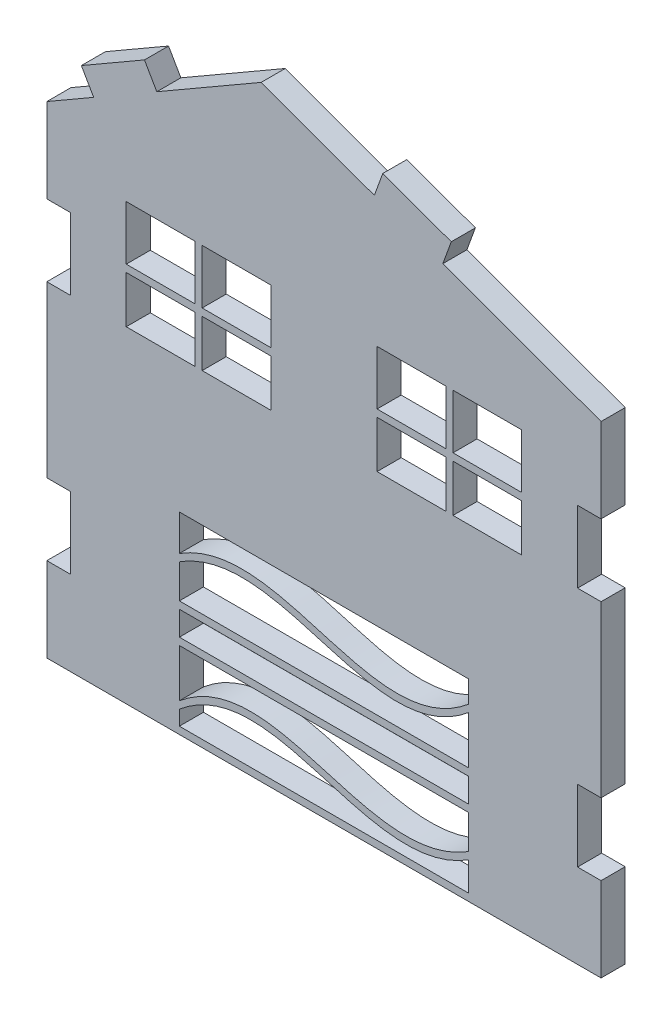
from build123d import *

# Parameters (mm, degrees)
SKETCH1_W           = 120
SKETCH1_H           = 10.03622205
SKETCH1_W_2         = 28.5
SKETCH1_H_2         = 22.5
SKETCH1_H_3         = 19.5
BOSS_EXTRUDE1_DEPTH = 10


with BuildPart() as part:
    # Sketch1 → Boss-Extrude1 (new body)
    with BuildSketch(Plane.XY):
        Polygon((-230, 0), (0, 0), (0, 35), (-9.76, 35), (-9.76, 64.76), (0, 64.76), (0, 135.24), (-9.76, 135.24), (-9.76, 165), (0, 165), (0, 175), (0, 200), (-65.667447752, 223.900996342), (-62.165161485, 233.523448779), (-90.581466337, 243.866137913), (-94.083752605, 234.243685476), (-141.068383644, 251.344692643), (-184.369653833, 226.344692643), (-189.489653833, 235.212792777), (-215.678262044, 220.092792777), (-210.558262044, 211.224692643), (-230, 200), (-230, 175), (-230, 165), (-220.24, 165), (-220.24, 135.24), (-230, 135.24), (-230, 64.76), (-220.24, 64.76), (-220.24, 35), (-230, 35), align=None)
        with Locations((-115, 40.018111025)):
            Rectangle(SKETCH1_W, SKETCH1_H, mode=Mode.SUBTRACT)
        with BuildLine():
            Line((-175, 80), (-55, 80))
            Line((-55, 80), (-55, 70.902148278))
            add(Edge.make_bspline(
                [(-175, 65.078208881), (-134.061450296, 90.844662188), (-93.755078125, 38.528093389), (-55, 70.902148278)],
                knots=[0, 0, 0, 0, 1, 1, 1, 1], degree=3))
            Line((-175, 65.078208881), (-175, 80))
        make_face(mode=Mode.SUBTRACT)
        with BuildLine():
            Line((-175, 32), (-55, 32))
            Line((-55, 32), (-55, 17.958013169))
            add(Edge.make_bspline(
                [(-55, 17.958013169), (-95.938549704, -7.808440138), (-136.244921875, 44.508128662), (-175, 12.134073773)],
                knots=[0, 0, 0, 0, 1, 1, 1, 1], degree=3))
            Line((-175, 12.134073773), (-175, 32))
        make_face(mode=Mode.SUBTRACT)
        with BuildLine():
            Line((-175, 62.078208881), (-175, 48.03622205))
            Line((-175, 48.03622205), (-55, 48.03622205))
            Line((-55, 48.03622205), (-55, 67.902148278))
            add(Edge.make_bspline(
                [(-175, 62.078208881), (-134.061450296, 87.844662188), (-93.755078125, 35.528093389), (-55, 67.902148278)],
                knots=[0, 0, 0, 0, 1, 1, 1, 1], degree=3))
        make_face(mode=Mode.SUBTRACT)
        with BuildLine():
            Line((-55, 14.958013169), (-55, 3))
            Line((-55, 3), (-175, 3))
            Line((-175, 3), (-175, 9.134073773))
            add(Edge.make_bspline(
                [(-55, 14.958013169), (-95.938549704, -10.808440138), (-136.244921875, 41.508128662), (-175, 9.134073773)],
                knots=[0, 0, 0, 0, 1, 1, 1, 1], degree=3))
        make_face(mode=Mode.SUBTRACT)
        with Locations((-182.801577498, 169.277582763)):
            Rectangle(SKETCH1_W_2, SKETCH1_H_2, mode=Mode.SUBTRACT)
        with Locations((-182.801577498, 145.277582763)):
            Rectangle(SKETCH1_W_2, SKETCH1_H_3, mode=Mode.SUBTRACT)
        with Locations((-151.301577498, 169.277582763)):
            Rectangle(SKETCH1_W_2, SKETCH1_H_2, mode=Mode.SUBTRACT)
        with Locations((-151.301577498, 145.277582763)):
            Rectangle(SKETCH1_W_2, SKETCH1_H_3, mode=Mode.SUBTRACT)
        with Locations((-78.698422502, 145.277582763)):
            Rectangle(SKETCH1_W_2, SKETCH1_H_3, mode=Mode.SUBTRACT)
        with Locations((-78.698422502, 169.277582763)):
            Rectangle(SKETCH1_W_2, SKETCH1_H_2, mode=Mode.SUBTRACT)
        with Locations((-47.198422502, 145.277582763)):
            Rectangle(SKETCH1_W_2, SKETCH1_H_3, mode=Mode.SUBTRACT)
        with Locations((-47.198422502, 169.277582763)):
            Rectangle(SKETCH1_W_2, SKETCH1_H_2, mode=Mode.SUBTRACT)
    extrude(amount=BOSS_EXTRUDE1_DEPTH)


solid = part.part
